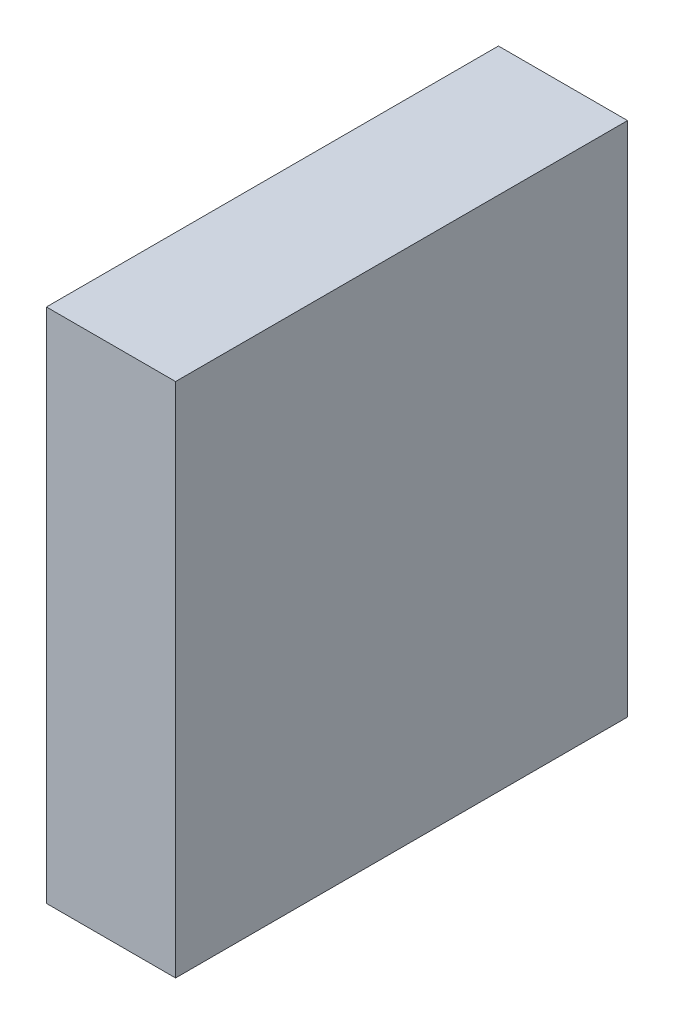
from build123d import *

# Parameters (mm, degrees)
CROQUIS1_W              = 2
CROQUIS1_H              = 8
SALIENTE_EXTRUIR1_DEPTH = 7


with BuildPart() as part:
    # Croquis1 → Saliente-Extruir1 (new body)
    with BuildSketch(Plane.XY):
        with Locations((1, 4)):
            Rectangle(CROQUIS1_W, CROQUIS1_H)
    extrude(amount=SALIENTE_EXTRUIR1_DEPTH)


solid = part.part
